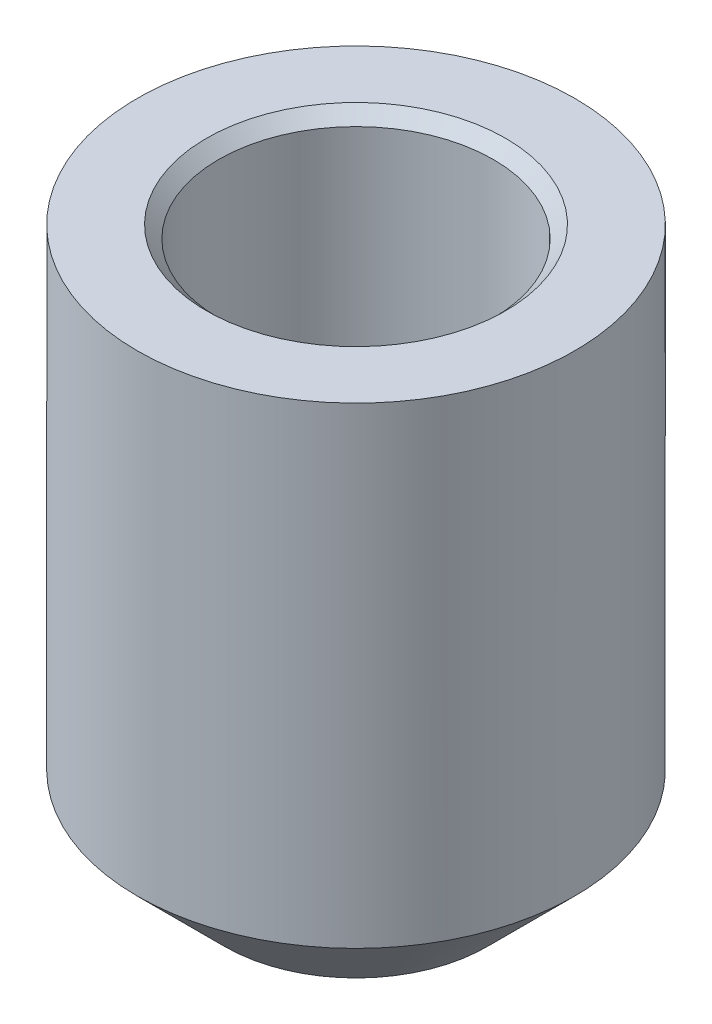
from build123d import *

# Parameters (mm, degrees)
CHAMFER1_SIZE      = 1.27
CHAMFER2_SIZE      = 0.1778
SKETCH2_OUTSIDE_W  = 13.13
SKETCH2_OUTSIDE_H  = 13.13
SKETCH2_OUTSIDE_R  = 3.17627
CUT_EXTRUDE1_DEPTH = 9.637419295
CHAMFER3_SIZE      = 0.1778


with BuildPart() as part:
    # Sketch1 → Revolve1 (revolve)
    with BuildSketch(Plane.XY, mode=Mode.PRIVATE) as revolve1_sk:
        Polygon((1.9939, 0), (1.9939, -3.556), (0, -3.556), (0, -8.128), (3.17627, -8.128), (3.17627, -1.778), (4.1402, -1.778), (4.1402, 0), align=None)
    revolve(revolve1_sk.sketch.rotate(Axis((0, 0, 0), (0, -1, 0)), 90), axis=Axis((0, 0, 0), (0, -1, 0)))

    # Chamfer1
    chamfer1_edges = [part.edges().sort_by_distance(p)[0] for p in [
        (0, -8.128, -3.17627),
    ]]
    chamfer(chamfer1_edges, length=CHAMFER1_SIZE)

    # Chamfer2
    chamfer2_edges = [part.edges().sort_by_distance(p)[0] for p in [
        (0, 0, -1.9939),
    ]]
    chamfer(chamfer2_edges, length=CHAMFER2_SIZE)

    # Sketch2 outside → Cut-Extrude1 (cut, through all)
    with BuildSketch(Plane.XZ.offset(1.778)):
        Rectangle(SKETCH2_OUTSIDE_W, SKETCH2_OUTSIDE_H)
        with Locations(Location((0, 0, 0), (0, 0, 90))):
            Circle(SKETCH2_OUTSIDE_R, mode=Mode.SUBTRACT)
    extrude(amount=-CUT_EXTRUDE1_DEPTH, mode=Mode.SUBTRACT)

    # Chamfer3
    chamfer3_edges = [part.edges().sort_by_distance(p)[0] for p in [
        (0, -3.556, -1.9939),
    ]]
    chamfer(chamfer3_edges, length=CHAMFER3_SIZE)


solid = part.part
